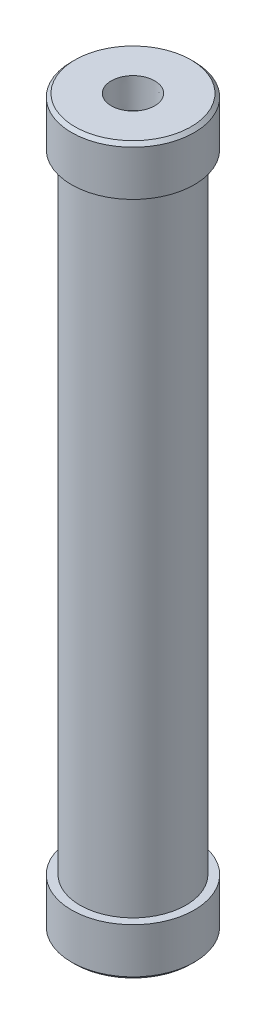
from build123d import *

# Parameters (mm, degrees)
SKETCH1_R           = 24.13
SKETCH1_R_2         = 20.32
BOSS_EXTRUDE1_DEPTH = 330.2
SKETCH2_R           = 27.94
BOSS_EXTRUDE2_DEPTH = 22.098
BOSS_EXTRUDE3_START = -22.098
SKETCH3_R           = 27.94
BOSS_EXTRUDE3_DEPTH = 22.098
CHAMFER1_SIZE       = 1.524


with BuildPart() as part:
    # Sketch1 → Boss-Extrude1 (new body)
    with BuildSketch(Plane(origin=(0, 0, 0), x_dir=(1, 0, 0), z_dir=(0, 1, 0))):
        with Locations(Location((0, 0, 0), (0, 0, 270))):
            Circle(SKETCH1_R)
        with Locations(Location((0, 0, 0), (0, 0, 270))):
            Circle(SKETCH1_R_2, mode=Mode.SUBTRACT)
    extrude(amount=BOSS_EXTRUDE1_DEPTH)

    # Sketch2 → Boss-Extrude2 (add)
    with BuildSketch(Plane(origin=(0, 0, 0), x_dir=(1, 0, 0), z_dir=(0, 1, 0))):
        with Locations(Location((0, 0, 0), (0, 0, 270))):
            Circle(SKETCH2_R)
    extrude(amount=BOSS_EXTRUDE2_DEPTH)

    # Sketch3 → Boss-Extrude3 (add)
    with BuildSketch(Plane(origin=(0, 330.2, 0), x_dir=(1, 0, 0), z_dir=(0, 1, 0)).offset(BOSS_EXTRUDE3_START)):
        with Locations(Location((0, 0, 0), (0, 0, 270))):
            Circle(SKETCH3_R)
    extrude(amount=BOSS_EXTRUDE3_DEPTH)

    # Sketch4 → 1_2 NPT Tapped Hole1 (revolve, cut)
    with BuildSketch(Plane(origin=(0, 330.2, 0), x_dir=(0, 0, 1), z_dir=(1, 0, 0))):
        Polygon((0, 0), (0, 27.970543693), (8.9281, 22.606), (8.9281, 13.462), (9.479726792, 13.462), (9.8827971, 0), align=None)
    revolve(axis=Axis((0, 336.55, 0), (0, -1, 0)), mode=Mode.SUBTRACT)

    # Sketch6 → 1_2 NPT Tapped Hole2 (revolve, cut)
    with BuildSketch(Plane(origin=(0, 0, 0), x_dir=(0, 0, -1), z_dir=(1, 0, 0))):
        Polygon((0, 0), (0, 27.970543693), (8.9281, 22.606), (8.9281, 13.462), (9.479726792, 13.462), (9.8827971, 0), align=None)
    revolve(axis=Axis((0, -6.35, 0), (0, 1, 0)), mode=Mode.SUBTRACT)

    # Chamfer1
    chamfer1_edges = [part.edges().sort_by_distance(p)[0] for p in [
        (0, 0, -27.94),
        (0, 330.2, -27.94),
    ]]
    chamfer(chamfer1_edges, length=CHAMFER1_SIZE)


solid = part.part
